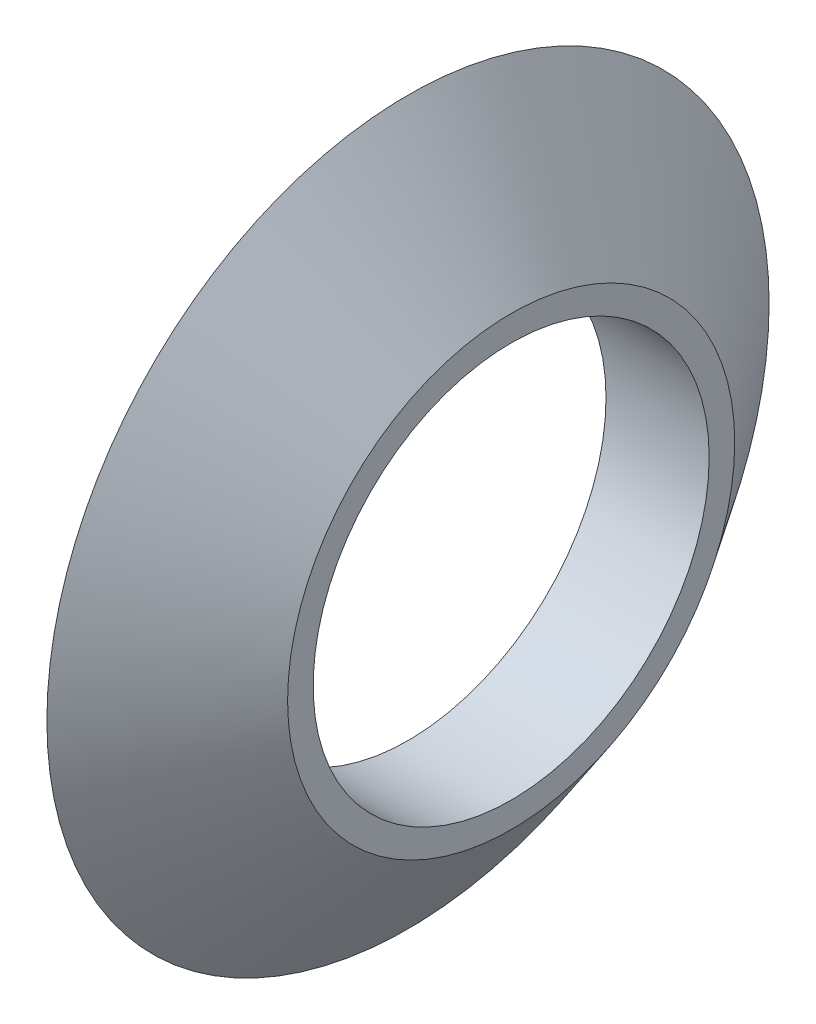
from build123d import *


with BuildPart() as part:
    # Esquisse1 → Base-R_volution (revolve)
    with BuildSketch(Plane.XY, mode=Mode.PRIVATE) as base_r_volution_sk:
        Polygon((-4.24, 5.653333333), (-2.625, 3.5), (-2.625, 3.1), (-4.24, 3.1), align=None)
    revolve(base_r_volution_sk.sketch.rotate(Axis((0, 0, 0), (-1, 0, 0)), 90), axis=Axis((0, 0, 0), (-1, 0, 0)))


solid = part.part
